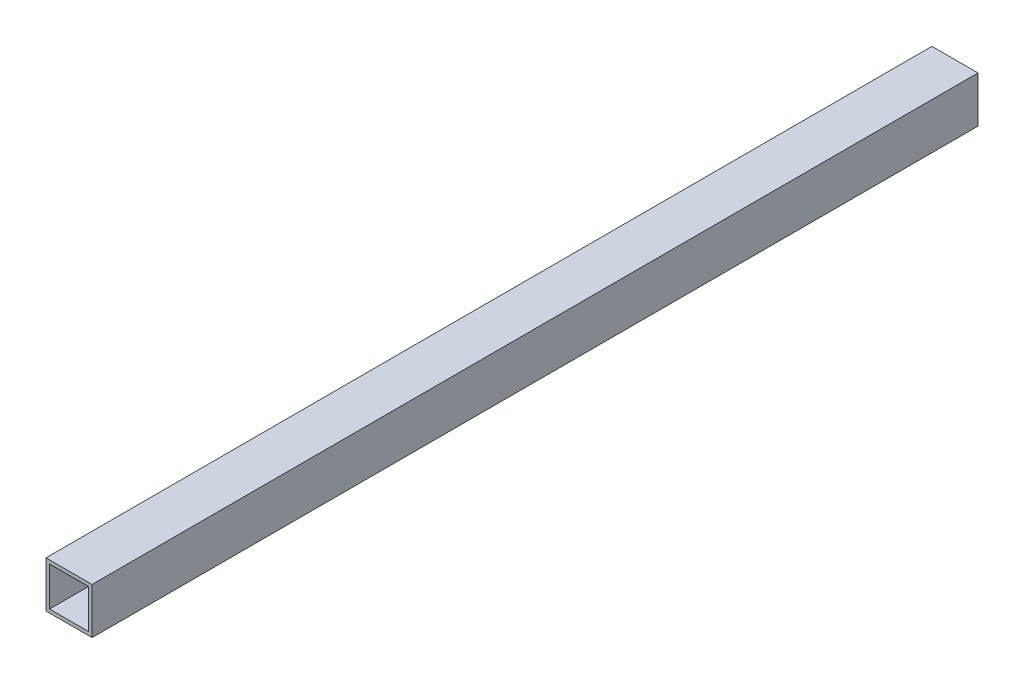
ISO-10303-21;
HEADER;
FILE_DESCRIPTION(('STEP AP214'),'2;1');
FILE_NAME('part.step','',(''),(''),'','','');
FILE_SCHEMA(('AUTOMOTIVE_DESIGN { 1 0 10303 214 1 1 1 1 }'));
ENDSEC;
DATA;
#1=APPLICATION_CONTEXT('core data for automotive mechanical design processes');
#2=APPLICATION_PROTOCOL_DEFINITION('international standard','automotive_design',2000,#1);
#3=PRODUCT_CONTEXT('',#1,'mechanical');
#4=PRODUCT('Part','Part','',(#3));
#5=PRODUCT_RELATED_PRODUCT_CATEGORY('part','',(#4));
#6=PRODUCT_DEFINITION_FORMATION('','',#4);
#7=PRODUCT_DEFINITION_CONTEXT('part definition',#1,'design');
#8=PRODUCT_DEFINITION('design','',#6,#7);
#9=PRODUCT_DEFINITION_SHAPE('','',#8);
#10=(LENGTH_UNIT() NAMED_UNIT(*) SI_UNIT(.MILLI.,.METRE.));
#11=(NAMED_UNIT(*) PLANE_ANGLE_UNIT() SI_UNIT($,.RADIAN.));
#12=(NAMED_UNIT(*) SI_UNIT($,.STERADIAN.) SOLID_ANGLE_UNIT());
#13=UNCERTAINTY_MEASURE_WITH_UNIT(LENGTH_MEASURE(1.E-05),#10,'distance_accuracy_value','');
#14=(GEOMETRIC_REPRESENTATION_CONTEXT(3) GLOBAL_UNCERTAINTY_ASSIGNED_CONTEXT((#13)) GLOBAL_UNIT_ASSIGNED_CONTEXT((#10,
#11,#12)) REPRESENTATION_CONTEXT('',''));
#15=CARTESIAN_POINT('',(0.,0.,0.));
#16=DIRECTION('',(0.,0.,1.));
#17=DIRECTION('',(1.,0.,0.));
#18=AXIS2_PLACEMENT_3D('',#15,#16,#17);
#19=CARTESIAN_POINT('',(0.,0.,500.));
#20=DIRECTION('',(0.,0.,1.));
#21=DIRECTION('',(1.,0.,0.));
#22=AXIS2_PLACEMENT_3D('',#19,#20,#21);
#23=PLANE('',#22);
#24=DIRECTION('',(0.,1.,0.));
#25=VECTOR('',#24,1.);
#26=CARTESIAN_POINT('',(13.,13.,500.));
#27=LINE('',#26,#25);
#28=CARTESIAN_POINT('',(13.,-13.,500.));
#29=VERTEX_POINT('',#28);
#30=CARTESIAN_POINT('',(13.,13.,500.));
#31=VERTEX_POINT('',#30);
#32=EDGE_CURVE('E157',#29,#31,#27,.T.);
#33=ORIENTED_EDGE('',*,*,#32,.T.);
#34=DIRECTION('',(-1.,0.,0.));
#35=VECTOR('',#34,1.);
#36=CARTESIAN_POINT('',(-13.,13.,500.));
#37=LINE('',#36,#35);
#38=CARTESIAN_POINT('',(-13.,13.,500.));
#39=VERTEX_POINT('',#38);
#40=EDGE_CURVE('E161',#31,#39,#37,.T.);
#41=ORIENTED_EDGE('',*,*,#40,.T.);
#42=DIRECTION('',(0.,-1.,0.));
#43=VECTOR('',#42,1.);
#44=CARTESIAN_POINT('',(-13.,13.,500.));
#45=LINE('',#44,#43);
#46=CARTESIAN_POINT('',(-13.,-13.,500.));
#47=VERTEX_POINT('',#46);
#48=EDGE_CURVE('E165',#39,#47,#45,.T.);
#49=ORIENTED_EDGE('',*,*,#48,.T.);
#50=DIRECTION('',(1.,0.,0.));
#51=VECTOR('',#50,1.);
#52=CARTESIAN_POINT('',(-13.,-13.,500.));
#53=LINE('',#52,#51);
#54=EDGE_CURVE('E168',#47,#29,#53,.T.);
#55=ORIENTED_EDGE('',*,*,#54,.T.);
#56=EDGE_LOOP('',(#33,#41,#49,#55));
#57=FACE_BOUND('',#56,.T.);
#58=DIRECTION('',(-1.,0.,0.));
#59=VECTOR('',#58,1.);
#60=CARTESIAN_POINT('',(-11.,11.,500.));
#61=LINE('',#60,#59);
#62=CARTESIAN_POINT('',(11.,11.,500.));
#63=VERTEX_POINT('',#62);
#64=CARTESIAN_POINT('',(-11.,11.,500.));
#65=VERTEX_POINT('',#64);
#66=EDGE_CURVE('E118',#63,#65,#61,.T.);
#67=ORIENTED_EDGE('',*,*,#66,.F.);
#68=DIRECTION('',(0.,1.,0.));
#69=VECTOR('',#68,1.);
#70=CARTESIAN_POINT('',(11.,11.,500.));
#71=LINE('',#70,#69);
#72=CARTESIAN_POINT('',(11.,-11.,500.));
#73=VERTEX_POINT('',#72);
#74=EDGE_CURVE('E109',#73,#63,#71,.T.);
#75=ORIENTED_EDGE('',*,*,#74,.F.);
#76=DIRECTION('',(1.,0.,0.));
#77=VECTOR('',#76,1.);
#78=CARTESIAN_POINT('',(-11.,-11.,500.));
#79=LINE('',#78,#77);
#80=CARTESIAN_POINT('',(-11.,-11.,500.));
#81=VERTEX_POINT('',#80);
#82=EDGE_CURVE('E135',#81,#73,#79,.T.);
#83=ORIENTED_EDGE('',*,*,#82,.F.);
#84=DIRECTION('',(0.,-1.,0.));
#85=VECTOR('',#84,1.);
#86=CARTESIAN_POINT('',(-11.,11.,500.));
#87=LINE('',#86,#85);
#88=EDGE_CURVE('E131',#65,#81,#87,.T.);
#89=ORIENTED_EDGE('',*,*,#88,.F.);
#90=EDGE_LOOP('',(#67,#75,#83,#89));
#91=FACE_BOUND('',#90,.T.);
#92=ADVANCED_FACE('F43',(#57,#91),#23,.T.);
#93=CARTESIAN_POINT('',(0.,0.,0.));
#94=DIRECTION('',(0.,0.,1.));
#95=DIRECTION('',(1.,0.,0.));
#96=AXIS2_PLACEMENT_3D('',#93,#94,#95);
#97=PLANE('',#96);
#98=DIRECTION('',(0.,1.,0.));
#99=VECTOR('',#98,1.);
#100=CARTESIAN_POINT('',(13.,13.,0.));
#101=LINE('',#100,#99);
#102=CARTESIAN_POINT('',(13.,-13.,0.));
#103=VERTEX_POINT('',#102);
#104=CARTESIAN_POINT('',(13.,13.,0.));
#105=VERTEX_POINT('',#104);
#106=EDGE_CURVE('E127',#103,#105,#101,.T.);
#107=ORIENTED_EDGE('',*,*,#106,.F.);
#108=DIRECTION('',(1.,0.,0.));
#109=VECTOR('',#108,1.);
#110=CARTESIAN_POINT('',(-13.,-13.,0.));
#111=LINE('',#110,#109);
#112=CARTESIAN_POINT('',(-13.,-13.,0.));
#113=VERTEX_POINT('',#112);
#114=EDGE_CURVE('E162',#113,#103,#111,.T.);
#115=ORIENTED_EDGE('',*,*,#114,.F.);
#116=DIRECTION('',(0.,-1.,0.));
#117=VECTOR('',#116,1.);
#118=CARTESIAN_POINT('',(-13.,13.,0.));
#119=LINE('',#118,#117);
#120=CARTESIAN_POINT('',(-13.,13.,0.));
#121=VERTEX_POINT('',#120);
#122=EDGE_CURVE('E178',#121,#113,#119,.T.);
#123=ORIENTED_EDGE('',*,*,#122,.F.);
#124=DIRECTION('',(-1.,0.,0.));
#125=VECTOR('',#124,1.);
#126=CARTESIAN_POINT('',(-13.,13.,0.));
#127=LINE('',#126,#125);
#128=EDGE_CURVE('E175',#105,#121,#127,.T.);
#129=ORIENTED_EDGE('',*,*,#128,.F.);
#130=EDGE_LOOP('',(#107,#115,#123,#129));
#131=FACE_BOUND('',#130,.T.);
#132=DIRECTION('',(0.,1.,0.));
#133=VECTOR('',#132,1.);
#134=CARTESIAN_POINT('',(11.,11.,0.));
#135=LINE('',#134,#133);
#136=CARTESIAN_POINT('',(11.,-11.,0.));
#137=VERTEX_POINT('',#136);
#138=CARTESIAN_POINT('',(11.,11.,0.));
#139=VERTEX_POINT('',#138);
#140=EDGE_CURVE('E67',#137,#139,#135,.T.);
#141=ORIENTED_EDGE('',*,*,#140,.T.);
#142=DIRECTION('',(-1.,0.,0.));
#143=VECTOR('',#142,1.);
#144=CARTESIAN_POINT('',(-11.,11.,0.));
#145=LINE('',#144,#143);
#146=CARTESIAN_POINT('',(-11.,11.,0.));
#147=VERTEX_POINT('',#146);
#148=EDGE_CURVE('E125',#139,#147,#145,.T.);
#149=ORIENTED_EDGE('',*,*,#148,.T.);
#150=DIRECTION('',(0.,-1.,0.));
#151=VECTOR('',#150,1.);
#152=CARTESIAN_POINT('',(-11.,11.,0.));
#153=LINE('',#152,#151);
#154=CARTESIAN_POINT('',(-11.,-11.,0.));
#155=VERTEX_POINT('',#154);
#156=EDGE_CURVE('E144',#147,#155,#153,.T.);
#157=ORIENTED_EDGE('',*,*,#156,.T.);
#158=DIRECTION('',(1.,0.,0.));
#159=VECTOR('',#158,1.);
#160=CARTESIAN_POINT('',(-11.,-11.,0.));
#161=LINE('',#160,#159);
#162=EDGE_CURVE('E119',#155,#137,#161,.T.);
#163=ORIENTED_EDGE('',*,*,#162,.T.);
#164=EDGE_LOOP('',(#141,#149,#157,#163));
#165=FACE_BOUND('',#164,.T.);
#166=ADVANCED_FACE('F201',(#131,#165),#97,.F.);
#167=CARTESIAN_POINT('',(13.,13.,500.));
#168=DIRECTION('',(-1.,0.,0.));
#169=DIRECTION('',(0.,-1.,0.));
#170=AXIS2_PLACEMENT_3D('',#167,#168,#169);
#171=PLANE('',#170);
#172=ORIENTED_EDGE('',*,*,#106,.T.);
#173=DIRECTION('',(0.,0.,-1.));
#174=VECTOR('',#173,1.);
#175=CARTESIAN_POINT('',(13.,13.,500.));
#176=LINE('',#175,#174);
#177=EDGE_CURVE('E11',#31,#105,#176,.T.);
#178=ORIENTED_EDGE('',*,*,#177,.F.);
#179=ORIENTED_EDGE('',*,*,#32,.F.);
#180=DIRECTION('',(0.,0.,-1.));
#181=VECTOR('',#180,1.);
#182=CARTESIAN_POINT('',(13.,-13.,500.));
#183=LINE('',#182,#181);
#184=EDGE_CURVE('E171',#29,#103,#183,.T.);
#185=ORIENTED_EDGE('',*,*,#184,.T.);
#186=EDGE_LOOP('',(#172,#178,#179,#185));
#187=FACE_BOUND('',#186,.T.);
#188=ADVANCED_FACE('F45',(#187),#171,.F.);
#189=CARTESIAN_POINT('',(-13.,13.,500.));
#190=DIRECTION('',(0.,-1.,0.));
#191=DIRECTION('',(0.,0.,-1.));
#192=AXIS2_PLACEMENT_3D('',#189,#190,#191);
#193=PLANE('',#192);
#194=ORIENTED_EDGE('',*,*,#128,.T.);
#195=DIRECTION('',(0.,0.,-1.));
#196=VECTOR('',#195,1.);
#197=CARTESIAN_POINT('',(-13.,13.,500.));
#198=LINE('',#197,#196);
#199=EDGE_CURVE('E52',#39,#121,#198,.T.);
#200=ORIENTED_EDGE('',*,*,#199,.F.);
#201=ORIENTED_EDGE('',*,*,#40,.F.);
#202=ORIENTED_EDGE('',*,*,#177,.T.);
#203=EDGE_LOOP('',(#194,#200,#201,#202));
#204=FACE_BOUND('',#203,.T.);
#205=ADVANCED_FACE('F211',(#204),#193,.F.);
#206=CARTESIAN_POINT('',(-13.,13.,500.));
#207=DIRECTION('',(1.,0.,0.));
#208=DIRECTION('',(0.,1.,0.));
#209=AXIS2_PLACEMENT_3D('',#206,#207,#208);
#210=PLANE('',#209);
#211=ORIENTED_EDGE('',*,*,#122,.T.);
#212=DIRECTION('',(0.,0.,-1.));
#213=VECTOR('',#212,1.);
#214=CARTESIAN_POINT('',(-13.,-13.,500.));
#215=LINE('',#214,#213);
#216=EDGE_CURVE('E186',#47,#113,#215,.T.);
#217=ORIENTED_EDGE('',*,*,#216,.F.);
#218=ORIENTED_EDGE('',*,*,#48,.F.);
#219=ORIENTED_EDGE('',*,*,#199,.T.);
#220=EDGE_LOOP('',(#211,#217,#218,#219));
#221=FACE_BOUND('',#220,.T.);
#222=ADVANCED_FACE('F195',(#221),#210,.F.);
#223=CARTESIAN_POINT('',(-13.,-13.,500.));
#224=DIRECTION('',(0.,1.,0.));
#225=DIRECTION('',(0.,0.,1.));
#226=AXIS2_PLACEMENT_3D('',#223,#224,#225);
#227=PLANE('',#226);
#228=ORIENTED_EDGE('',*,*,#114,.T.);
#229=ORIENTED_EDGE('',*,*,#184,.F.);
#230=ORIENTED_EDGE('',*,*,#54,.F.);
#231=ORIENTED_EDGE('',*,*,#216,.T.);
#232=EDGE_LOOP('',(#228,#229,#230,#231));
#233=FACE_BOUND('',#232,.T.);
#234=ADVANCED_FACE('F205',(#233),#227,.F.);
#235=CARTESIAN_POINT('',(11.,11.,500.));
#236=DIRECTION('',(-1.,0.,0.));
#237=DIRECTION('',(0.,0.,1.));
#238=AXIS2_PLACEMENT_3D('',#235,#236,#237);
#239=PLANE('',#238);
#240=ORIENTED_EDGE('',*,*,#140,.F.);
#241=DIRECTION('',(0.,0.,-1.));
#242=VECTOR('',#241,1.);
#243=CARTESIAN_POINT('',(11.,-11.,500.));
#244=LINE('',#243,#242);
#245=EDGE_CURVE('E113',#73,#137,#244,.T.);
#246=ORIENTED_EDGE('',*,*,#245,.F.);
#247=ORIENTED_EDGE('',*,*,#74,.T.);
#248=DIRECTION('',(0.,0.,-1.));
#249=VECTOR('',#248,1.);
#250=CARTESIAN_POINT('',(11.,11.,500.));
#251=LINE('',#250,#249);
#252=EDGE_CURVE('E112',#63,#139,#251,.T.);
#253=ORIENTED_EDGE('',*,*,#252,.T.);
#254=EDGE_LOOP('',(#240,#246,#247,#253));
#255=FACE_BOUND('',#254,.T.);
#256=ADVANCED_FACE('F111',(#255),#239,.T.);
#257=CARTESIAN_POINT('',(-11.,11.,500.));
#258=DIRECTION('',(0.,-1.,0.));
#259=DIRECTION('',(0.,0.,-1.));
#260=AXIS2_PLACEMENT_3D('',#257,#258,#259);
#261=PLANE('',#260);
#262=ORIENTED_EDGE('',*,*,#148,.F.);
#263=ORIENTED_EDGE('',*,*,#252,.F.);
#264=ORIENTED_EDGE('',*,*,#66,.T.);
#265=DIRECTION('',(0.,0.,-1.));
#266=VECTOR('',#265,1.);
#267=CARTESIAN_POINT('',(-11.,11.,500.));
#268=LINE('',#267,#266);
#269=EDGE_CURVE('E128',#65,#147,#268,.T.);
#270=ORIENTED_EDGE('',*,*,#269,.T.);
#271=EDGE_LOOP('',(#262,#263,#264,#270));
#272=FACE_BOUND('',#271,.T.);
#273=ADVANCED_FACE('F122',(#272),#261,.T.);
#274=CARTESIAN_POINT('',(-11.,11.,500.));
#275=DIRECTION('',(1.,0.,0.));
#276=DIRECTION('',(0.,0.,-1.));
#277=AXIS2_PLACEMENT_3D('',#274,#275,#276);
#278=PLANE('',#277);
#279=ORIENTED_EDGE('',*,*,#156,.F.);
#280=ORIENTED_EDGE('',*,*,#269,.F.);
#281=ORIENTED_EDGE('',*,*,#88,.T.);
#282=DIRECTION('',(0.,0.,-1.));
#283=VECTOR('',#282,1.);
#284=CARTESIAN_POINT('',(-11.,-11.,500.));
#285=LINE('',#284,#283);
#286=EDGE_CURVE('E59',#81,#155,#285,.T.);
#287=ORIENTED_EDGE('',*,*,#286,.T.);
#288=EDGE_LOOP('',(#279,#280,#281,#287));
#289=FACE_BOUND('',#288,.T.);
#290=ADVANCED_FACE('F234',(#289),#278,.T.);
#291=CARTESIAN_POINT('',(-11.,-11.,500.));
#292=DIRECTION('',(0.,1.,0.));
#293=DIRECTION('',(0.,0.,1.));
#294=AXIS2_PLACEMENT_3D('',#291,#292,#293);
#295=PLANE('',#294);
#296=ORIENTED_EDGE('',*,*,#162,.F.);
#297=ORIENTED_EDGE('',*,*,#286,.F.);
#298=ORIENTED_EDGE('',*,*,#82,.T.);
#299=ORIENTED_EDGE('',*,*,#245,.T.);
#300=EDGE_LOOP('',(#296,#297,#298,#299));
#301=FACE_BOUND('',#300,.T.);
#302=ADVANCED_FACE('F238',(#301),#295,.T.);
#303=CLOSED_SHELL('',(#92,#166,#188,#205,#222,#234,#256,#273,#290,#302));
#304=MANIFOLD_SOLID_BREP('B2',#303);
#305=ADVANCED_BREP_SHAPE_REPRESENTATION('',(#18,#304),#14);
#306=SHAPE_DEFINITION_REPRESENTATION(#9,#305);
ENDSEC;
END-ISO-10303-21;
